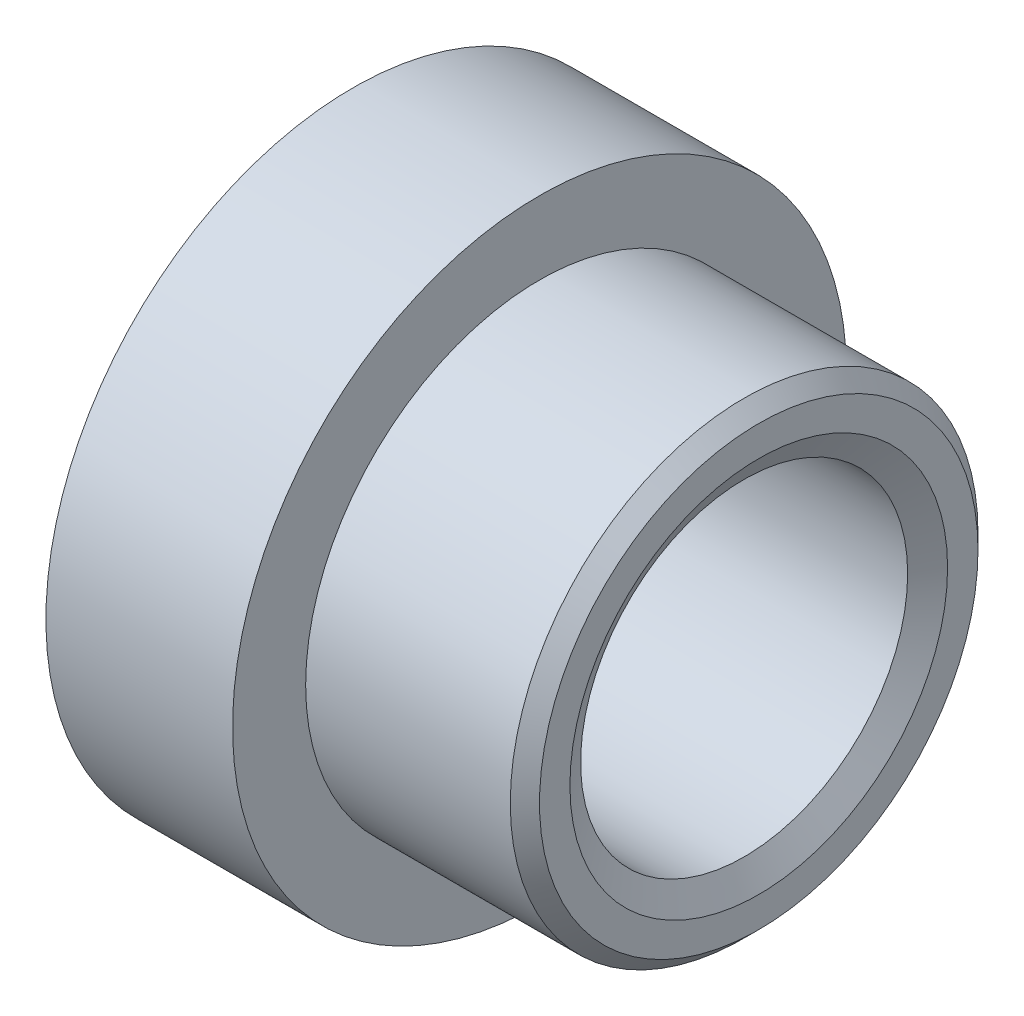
from build123d import *


with BuildPart() as part:
    # Sketch 1 → Revolve 1 (revolve)
    with BuildSketch(Plane.XY, mode=Mode.PRIVATE) as revolve_1_sk:
        with BuildLine():
            Line((0, -12.920050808), (0, -15))
            Line((0, -15), (-1, -16))
            Line((-1, -16), (-15, -16))
            Line((-15, -16), (-15, -21))
            Line((-15, -21), (-27.77013859, -21))
            ThreePointArc((-27.77013859, -21), (-29.440972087, -10.559027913), (-30, 0))
            Line((-30, 0), (-23, 0))
            Line((-23, 0), (-23, -12.5))
            Line((-23, -12.5), (-19, -12.5))
            Line((-19, -12.5), (-19, -11.188))
            Line((-19, -11.188), (-1, -11.188))
            Line((-1, -11.188), (0, -12.920050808))
        make_face()
    revolve(revolve_1_sk.sketch.rotate(Axis((0, 0, 0), (-1, 0, 0)), 270), axis=Axis((0, 0, 0), (-1, 0, 0)))


solid = part.part
